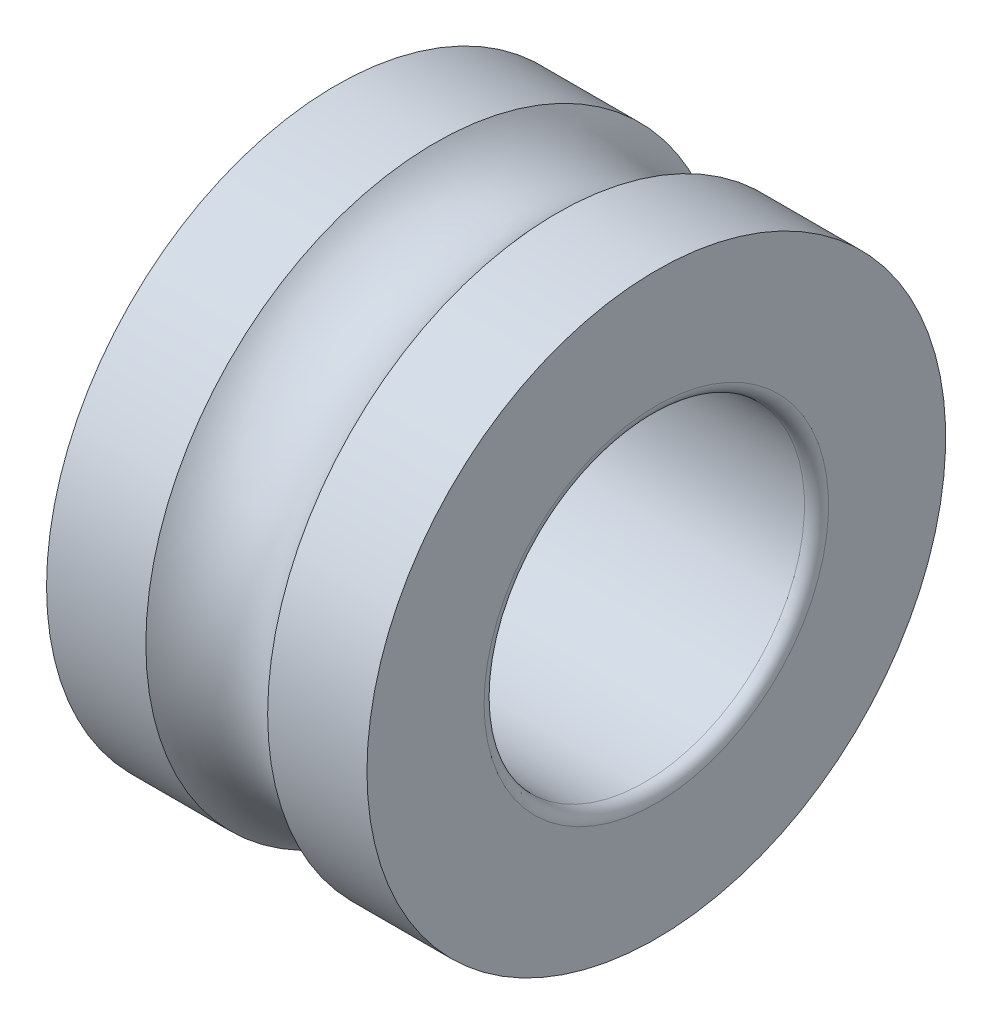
ISO-10303-21;
HEADER;
FILE_DESCRIPTION(('STEP AP214'),'2;1');
FILE_NAME('part.step','',(''),(''),'','','');
FILE_SCHEMA(('AUTOMOTIVE_DESIGN { 1 0 10303 214 1 1 1 1 }'));
ENDSEC;
DATA;
#1=APPLICATION_CONTEXT('core data for automotive mechanical design processes');
#2=APPLICATION_PROTOCOL_DEFINITION('international standard','automotive_design',2000,#1);
#3=PRODUCT_CONTEXT('',#1,'mechanical');
#4=PRODUCT('Part','Part','',(#3));
#5=PRODUCT_RELATED_PRODUCT_CATEGORY('part','',(#4));
#6=PRODUCT_DEFINITION_FORMATION('','',#4);
#7=PRODUCT_DEFINITION_CONTEXT('part definition',#1,'design');
#8=PRODUCT_DEFINITION('design','',#6,#7);
#9=PRODUCT_DEFINITION_SHAPE('','',#8);
#10=(LENGTH_UNIT() NAMED_UNIT(*) SI_UNIT(.MILLI.,.METRE.));
#11=(NAMED_UNIT(*) PLANE_ANGLE_UNIT() SI_UNIT($,.RADIAN.));
#12=(NAMED_UNIT(*) SI_UNIT($,.STERADIAN.) SOLID_ANGLE_UNIT());
#13=UNCERTAINTY_MEASURE_WITH_UNIT(LENGTH_MEASURE(1.E-05),#10,'distance_accuracy_value','');
#14=(GEOMETRIC_REPRESENTATION_CONTEXT(3) GLOBAL_UNCERTAINTY_ASSIGNED_CONTEXT((#13)) GLOBAL_UNIT_ASSIGNED_CONTEXT((#10,
#11,#12)) REPRESENTATION_CONTEXT('',''));
#15=CARTESIAN_POINT('',(0.,0.,0.));
#16=DIRECTION('',(0.,0.,1.));
#17=DIRECTION('',(1.,0.,0.));
#18=AXIS2_PLACEMENT_3D('',#15,#16,#17);
#19=CARTESIAN_POINT('',(4.,0.,0.));
#20=DIRECTION('',(-1.,0.,0.));
#21=DIRECTION('',(0.,0.,1.));
#22=AXIS2_PLACEMENT_3D('',#19,#20,#21);
#23=TOROIDAL_SURFACE('',#22,8.5,1.9845);
#24=CARTESIAN_POINT('',(5.520728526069,0.,0.));
#25=DIRECTION('',(-1.,0.,0.));
#26=DIRECTION('',(0.,0.,1.));
#27=AXIS2_PLACEMENT_3D('',#24,#25,#26);
#28=CIRCLE('',#27,7.225);
#29=CARTESIAN_POINT('',(5.520728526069,0.,7.225));
#30=VERTEX_POINT('',#29);
#31=EDGE_CURVE('E55',#30,#30,#28,.T.);
#32=ORIENTED_EDGE('',*,*,#31,.T.);
#33=EDGE_LOOP('',(#32));
#34=FACE_BOUND('',#33,.T.);
#35=CARTESIAN_POINT('',(2.479271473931,0.,0.));
#36=DIRECTION('',(-1.,0.,0.));
#37=DIRECTION('',(0.,0.,1.));
#38=AXIS2_PLACEMENT_3D('',#35,#36,#37);
#39=CIRCLE('',#38,7.225);
#40=CARTESIAN_POINT('',(2.479271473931,0.,7.225));
#41=VERTEX_POINT('',#40);
#42=EDGE_CURVE('E10',#41,#41,#39,.T.);
#43=ORIENTED_EDGE('',*,*,#42,.F.);
#44=EDGE_LOOP('',(#43));
#45=FACE_BOUND('',#44,.T.);
#46=ADVANCED_FACE('F14',(#34,#45),#23,.F.);
#47=CARTESIAN_POINT('',(0.,0.,0.));
#48=DIRECTION('',(-1.,0.,0.));
#49=DIRECTION('',(0.,0.,1.));
#50=AXIS2_PLACEMENT_3D('',#47,#48,#49);
#51=CYLINDRICAL_SURFACE('',#50,7.225);
#52=ORIENTED_EDGE('',*,*,#42,.T.);
#53=EDGE_LOOP('',(#52));
#54=FACE_BOUND('',#53,.T.);
#55=CARTESIAN_POINT('',(0.,0.,0.));
#56=DIRECTION('',(-1.,0.,0.));
#57=DIRECTION('',(0.,0.,1.));
#58=AXIS2_PLACEMENT_3D('',#55,#56,#57);
#59=CIRCLE('',#58,7.225);
#60=CARTESIAN_POINT('',(0.,0.,7.225));
#61=VERTEX_POINT('',#60);
#62=EDGE_CURVE('E21',#61,#61,#59,.T.);
#63=ORIENTED_EDGE('',*,*,#62,.F.);
#64=EDGE_LOOP('',(#63));
#65=FACE_BOUND('',#64,.T.);
#66=ADVANCED_FACE('F76',(#54,#65),#51,.T.);
#67=CARTESIAN_POINT('',(0.,4.3,0.));
#68=DIRECTION('',(-1.,0.,0.));
#69=DIRECTION('',(0.,0.,1.));
#70=AXIS2_PLACEMENT_3D('',#67,#68,#69);
#71=PLANE('',#70);
#72=ORIENTED_EDGE('',*,*,#62,.T.);
#73=EDGE_LOOP('',(#72));
#74=FACE_BOUND('',#73,.T.);
#75=CARTESIAN_POINT('',(0.,0.,0.));
#76=DIRECTION('',(-1.,0.,0.));
#77=DIRECTION('',(0.,0.,1.));
#78=AXIS2_PLACEMENT_3D('',#75,#76,#77);
#79=CIRCLE('',#78,4.3);
#80=CARTESIAN_POINT('',(0.,0.,4.3));
#81=VERTEX_POINT('',#80);
#82=EDGE_CURVE('E30',#81,#81,#79,.T.);
#83=ORIENTED_EDGE('',*,*,#82,.F.);
#84=EDGE_LOOP('',(#83));
#85=FACE_BOUND('',#84,.T.);
#86=ADVANCED_FACE('F80',(#74,#85),#71,.T.);
#87=CARTESIAN_POINT('',(0.3,0.,0.));
#88=DIRECTION('',(-1.,0.,0.));
#89=DIRECTION('',(0.,0.,1.));
#90=AXIS2_PLACEMENT_3D('',#87,#88,#89);
#91=TOROIDAL_SURFACE('',#90,4.3,0.3);
#92=CARTESIAN_POINT('',(0.3,0.,0.));
#93=DIRECTION('',(-1.,0.,0.));
#94=DIRECTION('',(0.,0.,1.));
#95=AXIS2_PLACEMENT_3D('',#92,#93,#94);
#96=CIRCLE('',#95,4.);
#97=CARTESIAN_POINT('',(0.3,0.,4.));
#98=VERTEX_POINT('',#97);
#99=EDGE_CURVE('E37',#98,#98,#96,.T.);
#100=ORIENTED_EDGE('',*,*,#99,.F.);
#101=EDGE_LOOP('',(#100));
#102=FACE_BOUND('',#101,.T.);
#103=ORIENTED_EDGE('',*,*,#82,.T.);
#104=EDGE_LOOP('',(#103));
#105=FACE_BOUND('',#104,.T.);
#106=ADVANCED_FACE('F84',(#102,#105),#91,.T.);
#107=CARTESIAN_POINT('',(0.,0.,0.));
#108=DIRECTION('',(-1.,0.,0.));
#109=DIRECTION('',(0.,0.,1.));
#110=AXIS2_PLACEMENT_3D('',#107,#108,#109);
#111=CYLINDRICAL_SURFACE('',#110,4.);
#112=CARTESIAN_POINT('',(7.7,0.,0.));
#113=DIRECTION('',(-1.,0.,0.));
#114=DIRECTION('',(0.,0.,1.));
#115=AXIS2_PLACEMENT_3D('',#112,#113,#114);
#116=CIRCLE('',#115,4.);
#117=CARTESIAN_POINT('',(7.7,0.,4.));
#118=VERTEX_POINT('',#117);
#119=EDGE_CURVE('E43',#118,#118,#116,.T.);
#120=ORIENTED_EDGE('',*,*,#119,.F.);
#121=EDGE_LOOP('',(#120));
#122=FACE_BOUND('',#121,.T.);
#123=ORIENTED_EDGE('',*,*,#99,.T.);
#124=EDGE_LOOP('',(#123));
#125=FACE_BOUND('',#124,.T.);
#126=ADVANCED_FACE('F90',(#122,#125),#111,.F.);
#127=CARTESIAN_POINT('',(7.7,0.,0.));
#128=DIRECTION('',(-1.,0.,0.));
#129=DIRECTION('',(0.,0.,1.));
#130=AXIS2_PLACEMENT_3D('',#127,#128,#129);
#131=TOROIDAL_SURFACE('',#130,4.3,0.3);
#132=CARTESIAN_POINT('',(8.,0.,0.));
#133=DIRECTION('',(-1.,0.,0.));
#134=DIRECTION('',(0.,0.,1.));
#135=AXIS2_PLACEMENT_3D('',#132,#133,#134);
#136=CIRCLE('',#135,4.3);
#137=CARTESIAN_POINT('',(8.,0.,4.3));
#138=VERTEX_POINT('',#137);
#139=EDGE_CURVE('E47',#138,#138,#136,.T.);
#140=ORIENTED_EDGE('',*,*,#139,.F.);
#141=EDGE_LOOP('',(#140));
#142=FACE_BOUND('',#141,.T.);
#143=ORIENTED_EDGE('',*,*,#119,.T.);
#144=EDGE_LOOP('',(#143));
#145=FACE_BOUND('',#144,.T.);
#146=ADVANCED_FACE('F72',(#142,#145),#131,.T.);
#147=CARTESIAN_POINT('',(8.,4.3,0.));
#148=DIRECTION('',(-1.,0.,0.));
#149=DIRECTION('',(0.,0.,1.));
#150=AXIS2_PLACEMENT_3D('',#147,#148,#149);
#151=PLANE('',#150);
#152=CARTESIAN_POINT('',(8.,0.,0.));
#153=DIRECTION('',(-1.,0.,0.));
#154=DIRECTION('',(0.,0.,1.));
#155=AXIS2_PLACEMENT_3D('',#152,#153,#154);
#156=CIRCLE('',#155,7.225);
#157=CARTESIAN_POINT('',(8.,0.,7.225));
#158=VERTEX_POINT('',#157);
#159=EDGE_CURVE('E51',#158,#158,#156,.T.);
#160=ORIENTED_EDGE('',*,*,#159,.F.);
#161=EDGE_LOOP('',(#160));
#162=FACE_BOUND('',#161,.T.);
#163=ORIENTED_EDGE('',*,*,#139,.T.);
#164=EDGE_LOOP('',(#163));
#165=FACE_BOUND('',#164,.T.);
#166=ADVANCED_FACE('F65',(#162,#165),#151,.F.);
#167=CARTESIAN_POINT('',(0.,0.,0.));
#168=DIRECTION('',(-1.,0.,0.));
#169=DIRECTION('',(0.,0.,1.));
#170=AXIS2_PLACEMENT_3D('',#167,#168,#169);
#171=CYLINDRICAL_SURFACE('',#170,7.225);
#172=ORIENTED_EDGE('',*,*,#159,.T.);
#173=EDGE_LOOP('',(#172));
#174=FACE_BOUND('',#173,.T.);
#175=ORIENTED_EDGE('',*,*,#31,.F.);
#176=EDGE_LOOP('',(#175));
#177=FACE_BOUND('',#176,.T.);
#178=ADVANCED_FACE('F63',(#174,#177),#171,.T.);
#179=CLOSED_SHELL('',(#46,#66,#86,#106,#126,#146,#166,#178));
#180=MANIFOLD_SOLID_BREP('B1',#179);
#181=ADVANCED_BREP_SHAPE_REPRESENTATION('',(#18,#180),#14);
#182=SHAPE_DEFINITION_REPRESENTATION(#9,#181);
ENDSEC;
END-ISO-10303-21;
